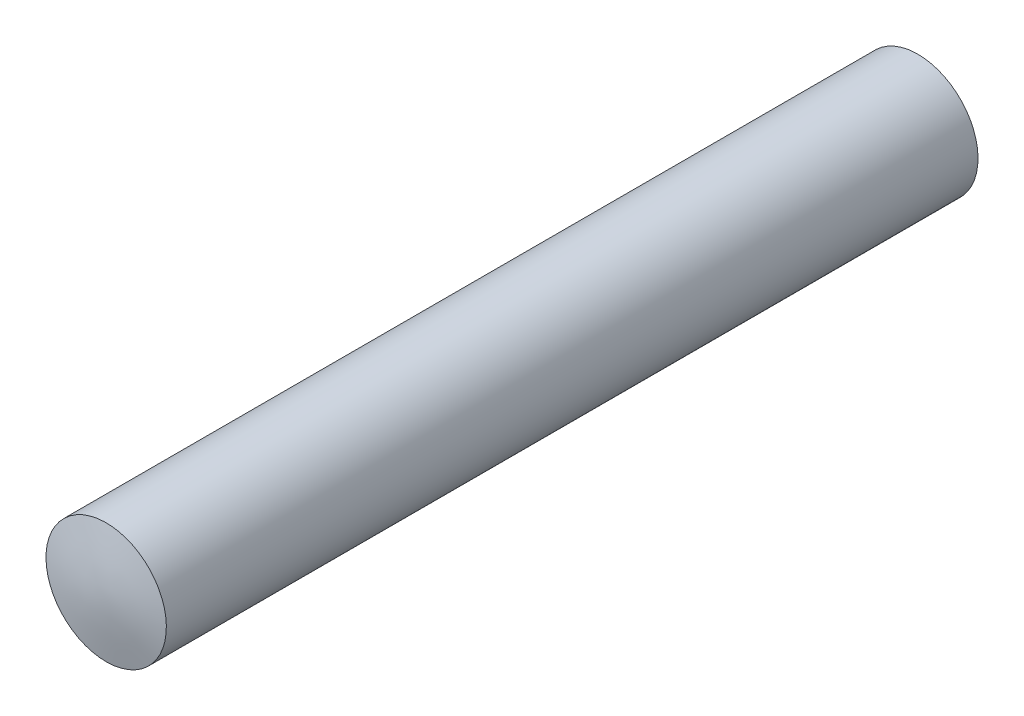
ISO-10303-21;
HEADER;
FILE_DESCRIPTION(('STEP AP214'),'2;1');
FILE_NAME('part.step','',(''),(''),'','','');
FILE_SCHEMA(('AUTOMOTIVE_DESIGN { 1 0 10303 214 1 1 1 1 }'));
ENDSEC;
DATA;
#1=APPLICATION_CONTEXT('core data for automotive mechanical design processes');
#2=APPLICATION_PROTOCOL_DEFINITION('international standard','automotive_design',2000,#1);
#3=PRODUCT_CONTEXT('',#1,'mechanical');
#4=PRODUCT('Part','Part','',(#3));
#5=PRODUCT_RELATED_PRODUCT_CATEGORY('part','',(#4));
#6=PRODUCT_DEFINITION_FORMATION('','',#4);
#7=PRODUCT_DEFINITION_CONTEXT('part definition',#1,'design');
#8=PRODUCT_DEFINITION('design','',#6,#7);
#9=PRODUCT_DEFINITION_SHAPE('','',#8);
#10=(LENGTH_UNIT() NAMED_UNIT(*) SI_UNIT(.MILLI.,.METRE.));
#11=(NAMED_UNIT(*) PLANE_ANGLE_UNIT() SI_UNIT($,.RADIAN.));
#12=(NAMED_UNIT(*) SI_UNIT($,.STERADIAN.) SOLID_ANGLE_UNIT());
#13=UNCERTAINTY_MEASURE_WITH_UNIT(LENGTH_MEASURE(1.E-05),#10,'distance_accuracy_value','');
#14=(GEOMETRIC_REPRESENTATION_CONTEXT(3) GLOBAL_UNCERTAINTY_ASSIGNED_CONTEXT((#13)) GLOBAL_UNIT_ASSIGNED_CONTEXT((#10,
#11,#12)) REPRESENTATION_CONTEXT('',''));
#15=CARTESIAN_POINT('',(0.,0.,0.));
#16=DIRECTION('',(0.,0.,1.));
#17=DIRECTION('',(1.,0.,0.));
#18=AXIS2_PLACEMENT_3D('',#15,#16,#17);
#19=CARTESIAN_POINT('',(0.,0.,10.7061));
#20=DIRECTION('',(0.,0.,-1.));
#21=DIRECTION('',(-1.,0.,0.));
#22=AXIS2_PLACEMENT_3D('',#19,#20,#21);
#23=CYLINDRICAL_SURFACE('',#22,1.5875);
#24=CARTESIAN_POINT('',(-1.5875,-1.49263197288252E-11,10.7062057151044));
#25=CARTESIAN_POINT('',(-1.58749604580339,-0.0891705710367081,10.7062060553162));
#26=CARTESIAN_POINT('',(-1.57996166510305,-0.178405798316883,10.7062164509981));
#27=CARTESIAN_POINT('',(-1.55001008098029,-0.354418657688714,10.7062147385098));
#28=CARTESIAN_POINT('',(-1.52757496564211,-0.44119320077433,10.7062026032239));
#29=CARTESIAN_POINT('',(-1.46846058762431,-0.609709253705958,10.7062039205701));
#30=CARTESIAN_POINT('',(-1.43178812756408,-0.691453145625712,10.706217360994));
#31=CARTESIAN_POINT('',(-1.34524940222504,-0.84760096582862,10.7062493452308));
#32=CARTESIAN_POINT('',(-1.29538641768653,-0.922006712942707,10.7062678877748));
#33=CARTESIAN_POINT('',(-1.18387200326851,-1.0614001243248,10.7062876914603));
#34=CARTESIAN_POINT('',(-1.12221934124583,-1.12638680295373,10.7062889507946));
#35=CARTESIAN_POINT('',(-0.988876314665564,-1.24508955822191,10.7062735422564));
#36=CARTESIAN_POINT('',(-0.917185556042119,-1.29880519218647,10.7062568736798));
#37=CARTESIAN_POINT('',(-0.765804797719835,-1.39343708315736,10.7062219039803));
#38=CARTESIAN_POINT('',(-0.686114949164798,-1.43435358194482,10.7062036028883));
#39=CARTESIAN_POINT('',(-0.520997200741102,-1.50222695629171,10.7062030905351));
#40=CARTESIAN_POINT('',(-0.435569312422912,-1.52918385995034,10.7062208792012));
#41=CARTESIAN_POINT('',(-0.26140023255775,-1.56837299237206,10.7062442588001));
#42=CARTESIAN_POINT('',(-0.172659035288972,-1.58060519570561,10.7062498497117));
#43=CARTESIAN_POINT('',(0.00561725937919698,-1.58999759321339,10.7062569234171));
#44=CARTESIAN_POINT('',(0.0951523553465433,-1.58715781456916,10.7062584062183));
#45=CARTESIAN_POINT('',(0.272475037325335,-1.56648691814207,10.7062423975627));
#46=CARTESIAN_POINT('',(0.360262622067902,-1.54865578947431,10.7062249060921));
#47=CARTESIAN_POINT('',(0.531598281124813,-1.4985083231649,10.7062044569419));
#48=CARTESIAN_POINT('',(0.615146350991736,-1.46619197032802,10.7062014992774));
#49=CARTESIAN_POINT('',(0.775631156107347,-1.38799143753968,10.7062201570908));
#50=CARTESIAN_POINT('',(0.852567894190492,-1.34210726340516,10.7062417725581));
#51=CARTESIAN_POINT('',(0.997646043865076,-1.23807361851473,10.7062742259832));
#52=CARTESIAN_POINT('',(1.06578745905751,-1.17992415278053,10.7062850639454));
#53=CARTESIAN_POINT('',(1.19134068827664,-1.05301058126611,10.7062874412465));
#54=CARTESIAN_POINT('',(1.24875249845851,-0.984246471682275,10.7062789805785));
#55=CARTESIAN_POINT('',(1.35121674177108,-0.838055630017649,10.7062491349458));
#56=CARTESIAN_POINT('',(1.3962691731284,-0.760628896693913,10.7062277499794));
#57=CARTESIAN_POINT('',(1.47273574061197,-0.599310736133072,10.7062059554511));
#58=CARTESIAN_POINT('',(1.50414987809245,-0.515419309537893,10.7062055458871));
#59=CARTESIAN_POINT('',(1.55244810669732,-0.343553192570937,10.7062085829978));
#60=CARTESIAN_POINT('',(1.56933219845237,-0.255578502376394,10.7062120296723));
#61=CARTESIAN_POINT('',(1.58809104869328,-0.0780431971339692,10.706211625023));
#62=CARTESIAN_POINT('',(1.58996580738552,0.0115174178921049,10.7062077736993));
#63=CARTESIAN_POINT('',(1.57865277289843,0.189682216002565,10.706208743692));
#64=CARTESIAN_POINT('',(1.56546497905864,0.278286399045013,10.7062135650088));
#65=CARTESIAN_POINT('',(1.5244011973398,0.452023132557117,10.7062102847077));
#66=CARTESIAN_POINT('',(1.49652520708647,0.537155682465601,10.7062021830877));
#67=CARTESIAN_POINT('',(1.42687635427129,0.701532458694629,10.7062147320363));
#68=CARTESIAN_POINT('',(1.38510349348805,0.780776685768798,10.7062353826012));
#69=CARTESIAN_POINT('',(1.2888467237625,0.931127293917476,10.7062690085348));
#70=CARTESIAN_POINT('',(1.23436281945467,1.00223367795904,10.7062819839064));
#71=CARTESIAN_POINT('',(1.1142305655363,1.13429016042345,10.7062888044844));
#72=CARTESIAN_POINT('',(1.04858221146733,1.19524025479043,10.7062826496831));
#73=CARTESIAN_POINT('',(0.907984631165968,1.30525393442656,10.7062557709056));
#74=CARTESIAN_POINT('',(0.833035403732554,1.3543175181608,10.7062350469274));
#75=CARTESIAN_POINT('',(0.675963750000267,1.43916535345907,10.7062068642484));
#76=CARTESIAN_POINT('',(0.593841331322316,1.47494961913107,10.7061994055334));
#77=CARTESIAN_POINT('',(0.424754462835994,1.53222307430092,10.7062137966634));
#78=CARTESIAN_POINT('',(0.337790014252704,1.55371226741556,10.706235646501));
#79=CARTESIAN_POINT('',(0.161487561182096,1.58178560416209,10.7062560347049));
#80=CARTESIAN_POINT('',(0.0721495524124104,1.58836972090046,10.7062545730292));
#81=CARTESIAN_POINT('',(-0.106363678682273,1.58644592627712,10.7062531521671));
#82=CARTESIAN_POINT('',(-0.195538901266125,1.57793803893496,10.7062531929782));
#83=CARTESIAN_POINT('',(-0.371195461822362,1.54607175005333,10.7062310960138));
#84=CARTESIAN_POINT('',(-0.457676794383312,1.52271331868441,10.7062089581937));
#85=CARTESIAN_POINT('',(-0.625491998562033,1.46180847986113,10.7061987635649));
#86=CARTESIAN_POINT('',(-0.706825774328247,1.42426180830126,10.7062107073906));
#87=CARTESIAN_POINT('',(-0.862032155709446,1.3360479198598,10.7062423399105));
#88=CARTESIAN_POINT('',(-0.935905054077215,1.28538121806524,10.7062620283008));
#89=CARTESIAN_POINT('',(-1.07408901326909,1.17237158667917,10.7062855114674));
#90=CARTESIAN_POINT('',(-1.13840107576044,1.11002988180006,10.7062893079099));
#91=CARTESIAN_POINT('',(-1.25566240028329,0.975416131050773,10.706278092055));
#92=CARTESIAN_POINT('',(-1.30860883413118,0.903141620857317,10.7062630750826));
#93=CARTESIAN_POINT('',(-1.40163627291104,0.75070131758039,10.7062291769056));
#94=CARTESIAN_POINT('',(-1.44171112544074,0.670531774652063,10.7062102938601));
#95=CARTESIAN_POINT('',(-1.50778654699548,0.504665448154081,10.7062016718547));
#96=CARTESIAN_POINT('',(-1.53380398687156,0.418975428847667,10.706211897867));
#97=CARTESIAN_POINT('',(-1.56409188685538,0.277282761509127,10.7062159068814));
#98=CARTESIAN_POINT('',(-1.57285897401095,0.222200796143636,10.7062144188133));
#99=CARTESIAN_POINT('',(-1.58456426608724,0.111420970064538,10.7062092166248));
#100=CARTESIAN_POINT('',(-1.58750247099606,0.0557231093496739,10.7062055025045));
#101=CARTESIAN_POINT('',(-1.5875,-1.49263197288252E-11,10.7062057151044));
#102=B_SPLINE_CURVE_WITH_KNOTS('',3,(#24,#25,#26,#27,#28,#29,#30,#31,#32,#33,#34,#35,#36,#37,
#38,#39,#40,#41,#42,#43,#44,#45,#46,#47,#48,#49,#50,#51,#52,#53,#54,#55,#56,#57,#58,#59,#60,#61,
#62,#63,#64,#65,#66,#67,#68,#69,#70,#71,#72,#73,#74,#75,#76,#77,#78,#79,#80,#81,#82,#83,#84,#85,
#86,#87,#88,#89,#90,#91,#92,#93,#94,#95,#96,#97,#98,#99,#100,#101),.UNSPECIFIED.,.T.,.F.,(4,2,2,
2,2,2,2,2,2,2,2,2,2,2,2,2,2,2,2,2,2,2,2,2,2,2,2,2,2,2,2,2,2,2,2,2,2,2,4),(0.,0.267308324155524,
0.534938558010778,0.802441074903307,1.06987712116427,1.33734113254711,1.60481564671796,
1.87228510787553,2.13975403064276,2.4072234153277,2.67469231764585,2.94216141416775,
3.20963079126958,3.4771000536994,3.74456920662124,4.01203845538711,4.27950774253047,
4.54697700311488,4.8144462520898,5.08191549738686,5.34938475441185,5.6168540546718,
5.88432332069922,6.15179248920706,6.41926176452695,6.68673107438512,6.95420010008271,
7.22166905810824,7.48913849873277,7.75660751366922,8.02407706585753,8.29155159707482,
8.55901562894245,8.8264516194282,9.09395408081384,9.36158421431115,9.628892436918,
9.79593466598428,9.96297689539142),.UNSPECIFIED.);
#103=CARTESIAN_POINT('',(-1.5875,-1.49263197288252E-11,10.7062057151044));
#104=VERTEX_POINT('',#103);
#105=EDGE_CURVE('E12',#104,#104,#102,.T.);
#106=ORIENTED_EDGE('',*,*,#105,.F.);
#107=EDGE_LOOP('',(#106));
#108=FACE_BOUND('',#107,.T.);
#109=CARTESIAN_POINT('',(-1.5875,1.50157528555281E-11,-10.706205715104));
#110=CARTESIAN_POINT('',(-1.58749604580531,-0.0891705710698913,-10.7062060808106));
#111=CARTESIAN_POINT('',(-1.57996166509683,-0.178405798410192,-10.7062165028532));
#112=CARTESIAN_POINT('',(-1.55001008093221,-0.35441865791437,-10.7062148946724));
#113=CARTESIAN_POINT('',(-1.52757496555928,-0.441193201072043,-10.7062028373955));
#114=CARTESIAN_POINT('',(-1.46846058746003,-0.609709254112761,-10.706204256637));
#115=CARTESIAN_POINT('',(-1.43178812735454,-0.691453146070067,-10.7062177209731));
#116=CARTESIAN_POINT('',(-1.34524940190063,-0.847600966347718,-10.706249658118));
#117=CARTESIAN_POINT('',(-1.29538641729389,-0.922006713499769,-10.7062681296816));
#118=CARTESIAN_POINT('',(-1.18387200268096,-1.06140012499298,-10.7062877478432));
#119=CARTESIAN_POINT('',(-1.12221934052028,-1.12638680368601,-10.7062888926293));
#120=CARTESIAN_POINT('',(-0.988876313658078,-1.24508955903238,-10.706273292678));
#121=CARTESIAN_POINT('',(-0.917185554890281,-1.29880519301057,-10.706256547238));
#122=CARTESIAN_POINT('',(-0.765804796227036,-1.39343708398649,-10.7062215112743));
#123=CARTESIAN_POINT('',(-0.686114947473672,-1.43435358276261,-10.7062032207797));
#124=CARTESIAN_POINT('',(-0.520997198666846,-1.50222695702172,-10.7062027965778));
#125=CARTESIAN_POINT('',(-0.435569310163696,-1.52918386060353,-10.7062206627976));
#126=CARTESIAN_POINT('',(-0.261400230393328,-1.56837299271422,-10.7062441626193));
#127=CARTESIAN_POINT('',(-0.172659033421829,-1.58060519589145,-10.7062497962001));
#128=CARTESIAN_POINT('',(0.00561726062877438,-1.58999759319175,-10.7062569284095));
#129=CARTESIAN_POINT('',(0.0951523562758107,-1.58715781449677,-10.7062584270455));
#130=CARTESIAN_POINT('',(0.272475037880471,-1.56648691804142,-10.7062424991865));
#131=CARTESIAN_POINT('',(0.360262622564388,-1.54865578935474,-10.7062250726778));
#132=CARTESIAN_POINT('',(0.531598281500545,-1.49850832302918,-10.7062047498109));
#133=CARTESIAN_POINT('',(0.61514635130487,-1.4661919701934,-10.7062018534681));
#134=CARTESIAN_POINT('',(0.77563115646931,-1.38799143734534,-10.706220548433));
#135=CARTESIAN_POINT('',(0.852567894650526,-1.3421072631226,-10.7062421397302));
#136=CARTESIAN_POINT('',(0.99764604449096,-1.23807361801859,-10.7062744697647));
#137=CARTESIAN_POINT('',(1.06578745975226,-1.17992415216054,-10.7062852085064));
#138=CARTESIAN_POINT('',(1.19134068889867,-1.05301058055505,-10.7062873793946));
#139=CARTESIAN_POINT('',(1.2487524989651,-0.984246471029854,-10.7062788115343));
#140=CARTESIAN_POINT('',(1.35121674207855,-0.838055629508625,-10.7062488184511));
#141=CARTESIAN_POINT('',(1.39626917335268,-0.760628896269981,-10.7062273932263));
#142=CARTESIAN_POINT('',(1.47273574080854,-0.599310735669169,-10.7062056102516));
#143=CARTESIAN_POINT('',(1.50414987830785,-0.515419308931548,-10.7062052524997));
#144=CARTESIAN_POINT('',(1.55244810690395,-0.343553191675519,-10.7062084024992));
#145=CARTESIAN_POINT('',(1.56933219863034,-0.255578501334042,-10.7062119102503));
#146=CARTESIAN_POINT('',(1.58809104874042,-0.0780431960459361,-10.7062115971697));
#147=CARTESIAN_POINT('',(1.5899658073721,0.01151741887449,-10.7062077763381));
#148=CARTESIAN_POINT('',(1.57865277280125,0.189682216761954,-10.7062088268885));
#149=CARTESIAN_POINT('',(1.56546497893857,0.278286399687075,-10.706213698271));
#150=CARTESIAN_POINT('',(1.52440119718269,0.452023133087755,-10.70621053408));
#151=CARTESIAN_POINT('',(1.49652520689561,0.537155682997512,-10.7062024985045));
#152=CARTESIAN_POINT('',(1.42687635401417,0.701532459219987,-10.7062150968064));
#153=CARTESIAN_POINT('',(1.3851034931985,0.780776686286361,-10.7062357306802));
#154=CARTESIAN_POINT('',(1.28884672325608,0.931127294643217,-10.7062692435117));
#155=CARTESIAN_POINT('',(1.23436281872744,1.00223367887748,-10.7062821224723));
#156=CARTESIAN_POINT('',(1.11423056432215,1.13429016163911,-10.706288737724));
#157=CARTESIAN_POINT('',(1.04858220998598,1.19524025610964,-10.7062824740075));
#158=CARTESIAN_POINT('',(0.907984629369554,1.30525393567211,-10.7062554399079));
#159=CARTESIAN_POINT('',(0.833035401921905,1.35431751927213,-10.706234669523));
#160=CARTESIAN_POINT('',(0.675963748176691,1.4391653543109,-10.7062064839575));
#161=CARTESIAN_POINT('',(0.593841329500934,1.47494961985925,-10.7061990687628));
#162=CARTESIAN_POINT('',(0.424754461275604,1.53222307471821,-10.706213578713));
#163=CARTESIAN_POINT('',(0.33779001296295,1.55371226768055,-10.7062355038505));
#164=CARTESIAN_POINT('',(0.16148756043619,1.58178560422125,-10.7062559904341));
#165=CARTESIAN_POINT('',(0.072149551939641,1.58836972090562,-10.7062545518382));
#166=CARTESIAN_POINT('',(-0.106363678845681,1.58644592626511,-10.7062531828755));
#167=CARTESIAN_POINT('',(-0.195538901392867,1.57793803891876,-10.7062532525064));
#168=CARTESIAN_POINT('',(-0.371195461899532,1.54607175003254,-10.7062312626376));
#169=CARTESIAN_POINT('',(-0.457676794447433,1.52271331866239,-10.7062092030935));
#170=CARTESIAN_POINT('',(-0.625491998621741,1.46180847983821,-10.7061991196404));
#171=CARTESIAN_POINT('',(-0.706825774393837,1.42426180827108,-10.7062110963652));
#172=CARTESIAN_POINT('',(-0.862032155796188,1.3360479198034,-10.7062427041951));
#173=CARTESIAN_POINT('',(-0.935905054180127,1.28538121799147,-10.7062623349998));
#174=CARTESIAN_POINT('',(-1.07408901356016,1.17237158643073,-10.7062856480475));
#175=CARTESIAN_POINT('',(-1.13840107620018,1.11002988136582,-10.7062893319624));
#176=CARTESIAN_POINT('',(-1.25566240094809,0.975416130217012,-10.7062779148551));
#177=CARTESIAN_POINT('',(-1.30860883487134,0.903141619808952,-10.7062628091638));
#178=CARTESIAN_POINT('',(-1.40163627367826,0.750701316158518,-10.7062288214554));
#179=CARTESIAN_POINT('',(-1.44171112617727,0.670531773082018,-10.7062099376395));
#180=CARTESIAN_POINT('',(-1.50778654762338,0.504665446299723,-10.7062013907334));
#181=CARTESIAN_POINT('',(-1.53380398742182,0.418975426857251,-10.7062116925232));
#182=CARTESIAN_POINT('',(-1.56409188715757,0.277282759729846,-10.7062157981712));
#183=CARTESIAN_POINT('',(-1.57285897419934,0.222200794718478,-10.7062143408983));
#184=CARTESIAN_POINT('',(-1.58456426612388,0.111420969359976,-10.7062091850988));
#185=CARTESIAN_POINT('',(-1.58750247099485,0.0557231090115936,-10.7062054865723));
#186=CARTESIAN_POINT('',(-1.5875,1.50157528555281E-11,-10.706205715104));
#187=B_SPLINE_CURVE_WITH_KNOTS('',3,(#109,#110,#111,#112,#113,#114,#115,#116,#117,#118,#119,
#120,#121,#122,#123,#124,#125,#126,#127,#128,#129,#130,#131,#132,#133,#134,#135,#136,#137,#138,
#139,#140,#141,#142,#143,#144,#145,#146,#147,#148,#149,#150,#151,#152,#153,#154,#155,#156,#157,
#158,#159,#160,#161,#162,#163,#164,#165,#166,#167,#168,#169,#170,#171,#172,#173,#174,#175,#176,
#177,#178,#179,#180,#181,#182,#183,#184,#185,#186),.UNSPECIFIED.,.T.,.F.,(4,2,2,2,2,2,2,2,2,2,2,
2,2,2,2,2,2,2,2,2,2,2,2,2,2,2,2,2,2,2,2,2,2,2,2,2,2,2,4),(0.,0.267308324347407,
0.534938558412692,0.802441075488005,1.06987712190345,1.33734113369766,1.60481564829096,
1.8722851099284,2.13975403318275,2.40722341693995,2.6746923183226,2.94216141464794,
3.20963079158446,3.47710005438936,3.74456920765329,4.01203845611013,4.27950774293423,
4.54697700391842,4.81444625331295,5.08191549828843,5.34938475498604,5.61685405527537,
5.88432332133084,6.15179249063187,6.41926176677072,6.68673107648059,6.95420010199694,
7.22166905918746,7.48913849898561,7.756607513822,8.02407706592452,8.29155159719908,
8.55901562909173,8.82645162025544,9.09395408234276,9.36158421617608,9.62889243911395,
9.79593466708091,9.96297689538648),.UNSPECIFIED.);
#188=CARTESIAN_POINT('',(-1.5875,1.50157528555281E-11,-10.706205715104));
#189=VERTEX_POINT('',#188);
#190=EDGE_CURVE('E107',#189,#189,#187,.T.);
#191=ORIENTED_EDGE('',*,*,#190,.T.);
#192=EDGE_LOOP('',(#191));
#193=FACE_BOUND('',#192,.T.);
#194=ADVANCED_FACE('F93',(#108,#193),#23,.T.);
#195=CARTESIAN_POINT('',(1.68852205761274,-1.61923509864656,10.5525788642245));
#196=CARTESIAN_POINT('',(1.41835918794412,-1.61923509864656,10.5895951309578));
#197=CARTESIAN_POINT('',(1.14819631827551,-1.61923509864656,10.6232669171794));
#198=CARTESIAN_POINT('',(0.878033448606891,-1.61923509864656,10.654639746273));
#199=CARTESIAN_POINT('',(0.472788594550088,-1.61923509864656,10.6906518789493));
#200=CARTESIAN_POINT('',(0.0675437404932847,-1.61923509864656,10.7006069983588));
#201=CARTESIAN_POINT('',(-0.0675382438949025,-1.61923509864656,10.7006070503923));
#202=CARTESIAN_POINT('',(-0.472784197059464,-1.61923509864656,10.6906523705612));
#203=CARTESIAN_POINT('',(-0.878030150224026,-1.61923509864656,10.6546408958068));
#204=CARTESIAN_POINT('',(-1.1481941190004,-1.61923509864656,10.6232680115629));
#205=CARTESIAN_POINT('',(-1.41835808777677,-1.61923509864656,10.5895957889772));
#206=CARTESIAN_POINT('',(-1.68852205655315,-1.61923509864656,10.5525789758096));
#207=CARTESIAN_POINT('',(1.68852205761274,-1.36015811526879,10.5856697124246));
#208=CARTESIAN_POINT('',(1.41835918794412,-1.36015811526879,10.6285133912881));
#209=CARTESIAN_POINT('',(1.14819631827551,-1.36015811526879,10.6679637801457));
#210=CARTESIAN_POINT('',(0.878033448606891,-1.36015811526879,10.7053592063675));
#211=CARTESIAN_POINT('',(0.472788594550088,-1.36015811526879,10.7485364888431));
#212=CARTESIAN_POINT('',(0.0675437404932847,-1.36015811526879,10.7604944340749));
#213=CARTESIAN_POINT('',(-0.0675382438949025,-1.36015811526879,10.7604945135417));
#214=CARTESIAN_POINT('',(-0.472784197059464,-1.36015811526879,10.7485370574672));
#215=CARTESIAN_POINT('',(-0.878030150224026,-1.36015811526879,10.7053602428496));
#216=CARTESIAN_POINT('',(-1.1481941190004,-1.36015811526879,10.6679644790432));
#217=CARTESIAN_POINT('',(-1.41835808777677,-1.36015811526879,10.6285136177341));
#218=CARTESIAN_POINT('',(-1.68852205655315,-1.36015811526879,10.5856693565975));
#219=CARTESIAN_POINT('',(1.68852205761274,-1.10108113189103,10.6156878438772));
#220=CARTESIAN_POINT('',(1.41835918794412,-1.10108113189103,10.6643130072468));
#221=CARTESIAN_POINT('',(1.14819631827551,-1.10108113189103,10.7094462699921));
#222=CARTESIAN_POINT('',(0.878033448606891,-1.10108113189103,10.7530804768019));
#223=CARTESIAN_POINT('',(0.472788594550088,-1.10108113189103,10.8036566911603));
#224=CARTESIAN_POINT('',(0.0675437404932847,-1.10108113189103,10.8176837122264));
#225=CARTESIAN_POINT('',(-0.0675382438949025,-1.10108113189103,10.8176838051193));
#226=CARTESIAN_POINT('',(-0.472784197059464,-1.10108113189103,10.8036573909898));
#227=CARTESIAN_POINT('',(-0.878030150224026,-1.10108113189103,10.7530813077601));
#228=CARTESIAN_POINT('',(-1.1481941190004,-1.10108113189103,10.709446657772));
#229=CARTESIAN_POINT('',(-1.41835808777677,-1.10108113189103,10.6643128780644));
#230=CARTESIAN_POINT('',(-1.68852205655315,-1.10108113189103,10.6156870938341));
#231=CARTESIAN_POINT('',(1.68852205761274,-0.842004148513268,10.6435630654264));
#232=CARTESIAN_POINT('',(1.41835918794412,-0.842004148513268,10.6982260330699));
#233=CARTESIAN_POINT('',(1.14819631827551,-0.842004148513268,10.7495761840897));
#234=CARTESIAN_POINT('',(0.878033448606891,-0.842004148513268,10.8000077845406));
#235=CARTESIAN_POINT('',(0.472788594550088,-0.842004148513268,10.8575481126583));
#236=CARTESIAN_POINT('',(0.0675437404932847,-0.842004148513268,10.8736895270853));
#237=CARTESIAN_POINT('',(-0.0675382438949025,-0.842004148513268,10.8736896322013));
#238=CARTESIAN_POINT('',(-0.472784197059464,-0.842004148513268,10.8575487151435));
#239=CARTESIAN_POINT('',(-0.878030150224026,-0.842004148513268,10.8000084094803));
#240=CARTESIAN_POINT('',(-1.1481941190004,-0.842004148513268,10.7495762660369));
#241=CARTESIAN_POINT('',(-1.41835808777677,-0.842004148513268,10.69822566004));
#242=CARTESIAN_POINT('',(-1.68852205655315,-0.842004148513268,10.643562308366));
#243=CARTESIAN_POINT('',(1.68852205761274,-0.45338814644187,10.6752947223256));
#244=CARTESIAN_POINT('',(1.41835918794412,-0.45338814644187,10.7372426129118));
#245=CARTESIAN_POINT('',(1.14819631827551,-0.45338814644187,10.7961485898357));
#246=CARTESIAN_POINT('',(0.878033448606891,-0.45338814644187,10.8536507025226));
#247=CARTESIAN_POINT('',(0.472788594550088,-0.45338814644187,10.9244525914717));
#248=CARTESIAN_POINT('',(0.0675437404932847,-0.45338814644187,10.9446353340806));
#249=CARTESIAN_POINT('',(-0.0675382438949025,-0.45338814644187,10.9446354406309));
#250=CARTESIAN_POINT('',(-0.472784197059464,-0.45338814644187,10.9244532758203));
#251=CARTESIAN_POINT('',(-0.878030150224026,-0.45338814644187,10.8536513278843));
#252=CARTESIAN_POINT('',(-1.1481941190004,-0.45338814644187,10.7961488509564));
#253=CARTESIAN_POINT('',(-1.41835808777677,-0.45338814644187,10.7372427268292));
#254=CARTESIAN_POINT('',(-1.68852205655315,-0.45338814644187,10.6752945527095));
#255=CARTESIAN_POINT('',(1.68852205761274,-0.0647721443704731,10.6839854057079));
#256=CARTESIAN_POINT('',(1.41835918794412,-0.0647721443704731,10.7479902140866));
#257=CARTESIAN_POINT('',(1.14819631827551,-0.0647721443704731,10.8090663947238));
#258=CARTESIAN_POINT('',(0.878033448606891,-0.0647721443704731,10.868728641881));
#259=CARTESIAN_POINT('',(0.472788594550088,-0.0647721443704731,10.9435838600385));
#260=CARTESIAN_POINT('',(0.0675437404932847,-0.0647721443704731,10.9667462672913));
#261=CARTESIAN_POINT('',(-0.0675382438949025,-0.0647721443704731,10.9667464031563));
#262=CARTESIAN_POINT('',(-0.472784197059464,-0.0647721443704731,10.9435846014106));
#263=CARTESIAN_POINT('',(-0.878030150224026,-0.0647721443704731,10.8687293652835));
#264=CARTESIAN_POINT('',(-1.1481941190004,-0.0647721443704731,10.8090668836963));
#265=CARTESIAN_POINT('',(-1.41835808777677,-0.0647721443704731,10.7479904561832));
#266=CARTESIAN_POINT('',(-1.68852205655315,-0.0647721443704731,10.683985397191));
#267=CARTESIAN_POINT('',(1.68852205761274,0.0647668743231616,10.6839854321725));
#268=CARTESIAN_POINT('',(1.41835918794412,0.0647668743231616,10.7479902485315));
#269=CARTESIAN_POINT('',(1.14819631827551,0.0647668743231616,10.8090664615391));
#270=CARTESIAN_POINT('',(0.878033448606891,0.0647668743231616,10.8687287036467));
#271=CARTESIAN_POINT('',(0.472788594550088,0.0647668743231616,10.9435839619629));
#272=CARTESIAN_POINT('',(0.0675437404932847,0.0647668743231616,10.9667463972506));
#273=CARTESIAN_POINT('',(-0.0675382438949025,0.0647668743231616,10.9667465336));
#274=CARTESIAN_POINT('',(-0.472784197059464,0.0647668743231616,10.9435847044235));
#275=CARTESIAN_POINT('',(-0.878030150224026,0.0647668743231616,10.8687294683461));
#276=CARTESIAN_POINT('',(-1.1481941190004,0.0647668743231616,10.8090669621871));
#277=CARTESIAN_POINT('',(-1.41835808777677,0.0647668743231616,10.7479905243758));
#278=CARTESIAN_POINT('',(-1.68852205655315,0.0647668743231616,10.6839854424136));
#279=CARTESIAN_POINT('',(1.68852205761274,0.453383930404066,10.6752948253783));
#280=CARTESIAN_POINT('',(1.41835918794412,0.453383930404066,10.7372428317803));
#281=CARTESIAN_POINT('',(1.14819631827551,0.453383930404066,10.7961488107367));
#282=CARTESIAN_POINT('',(0.878033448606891,0.453383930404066,10.8536511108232));
#283=CARTESIAN_POINT('',(0.472788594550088,0.453383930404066,10.9244532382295));
#284=CARTESIAN_POINT('',(0.0675437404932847,0.453383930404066,10.944636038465));
#285=CARTESIAN_POINT('',(-0.0675382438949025,0.453383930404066,10.9446361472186));
#286=CARTESIAN_POINT('',(-0.472784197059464,0.453383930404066,10.924453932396));
#287=CARTESIAN_POINT('',(-0.878030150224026,0.453383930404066,10.8536519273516));
#288=CARTESIAN_POINT('',(-1.1481941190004,0.453383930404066,10.7961495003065));
#289=CARTESIAN_POINT('',(-1.41835808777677,0.453383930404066,10.7372432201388));
#290=CARTESIAN_POINT('',(-1.68852205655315,0.453383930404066,10.6752949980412));
#291=CARTESIAN_POINT('',(1.68852205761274,0.84200098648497,10.6435626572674));
#292=CARTESIAN_POINT('',(1.41835918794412,0.84200098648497,10.6982258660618));
#293=CARTESIAN_POINT('',(1.14819631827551,0.84200098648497,10.7495763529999));
#294=CARTESIAN_POINT('',(0.878033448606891,0.84200098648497,10.8000083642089));
#295=CARTESIAN_POINT('',(0.472788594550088,0.84200098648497,10.8575488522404));
#296=CARTESIAN_POINT('',(0.0675437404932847,0.84200098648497,10.8736902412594));
#297=CARTESIAN_POINT('',(-0.0675382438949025,0.84200098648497,10.8736903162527));
#298=CARTESIAN_POINT('',(-0.472784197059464,0.84200098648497,10.8575493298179));
#299=CARTESIAN_POINT('',(-0.878030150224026,0.84200098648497,10.8000089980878));
#300=CARTESIAN_POINT('',(-1.1481941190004,0.84200098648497,10.7495771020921));
#301=CARTESIAN_POINT('',(-1.41835808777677,0.84200098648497,10.6982266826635));
#302=CARTESIAN_POINT('',(-1.68852205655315,0.84200098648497,10.6435634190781));
#303=CARTESIAN_POINT('',(1.68852205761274,1.10107902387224,10.6156873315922));
#304=CARTESIAN_POINT('',(1.41835918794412,1.10107902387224,10.6643129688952));
#305=CARTESIAN_POINT('',(1.14819631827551,1.10107902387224,10.7094466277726));
#306=CARTESIAN_POINT('',(0.878033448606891,1.10107902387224,10.7530811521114));
#307=CARTESIAN_POINT('',(0.472788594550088,1.10107902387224,10.8036573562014));
#308=CARTESIAN_POINT('',(0.0675437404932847,1.10107902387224,10.8176841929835));
#309=CARTESIAN_POINT('',(-0.0675382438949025,1.10107902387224,10.8176842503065));
#310=CARTESIAN_POINT('',(-0.472784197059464,1.10107902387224,10.80365761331));
#311=CARTESIAN_POINT('',(-0.878030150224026,1.10107902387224,10.7530814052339));
#312=CARTESIAN_POINT('',(-1.1481941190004,1.10107902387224,10.7094469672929));
#313=CARTESIAN_POINT('',(-1.41835808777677,1.10107902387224,10.6643134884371));
#314=CARTESIAN_POINT('',(-1.68852205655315,1.10107902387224,10.6156880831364));
#315=CARTESIAN_POINT('',(1.68852205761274,1.36015706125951,10.5856694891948));
#316=CARTESIAN_POINT('',(1.41835918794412,1.36015706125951,10.6285136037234));
#317=CARTESIAN_POINT('',(1.14819631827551,1.36015706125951,10.6679643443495));
#318=CARTESIAN_POINT('',(0.878033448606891,1.36015706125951,10.705359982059));
#319=CARTESIAN_POINT('',(0.472788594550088,1.36015706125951,10.7485368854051));
#320=CARTESIAN_POINT('',(0.0675437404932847,1.36015706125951,10.760494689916));
#321=CARTESIAN_POINT('',(-0.0675382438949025,1.36015706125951,10.7604947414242));
#322=CARTESIAN_POINT('',(-0.472784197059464,1.36015706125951,10.7485371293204));
#323=CARTESIAN_POINT('',(-0.878030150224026,1.36015706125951,10.7053598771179));
#324=CARTESIAN_POINT('',(-1.1481941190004,1.36015706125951,10.6679642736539));
#325=CARTESIAN_POINT('',(-1.41835808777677,1.36015706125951,10.6285137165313));
#326=CARTESIAN_POINT('',(-1.68852205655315,1.36015706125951,10.5856698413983));
#327=CARTESIAN_POINT('',(1.68852205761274,1.61923509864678,10.5525789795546));
#328=CARTESIAN_POINT('',(1.41835918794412,1.61923509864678,10.5895956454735));
#329=CARTESIAN_POINT('',(1.14819631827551,1.61923509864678,10.6232677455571));
#330=CARTESIAN_POINT('',(0.878033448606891,1.61923509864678,10.6546405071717));
#331=CARTESIAN_POINT('',(0.472788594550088,1.61923509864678,10.6906520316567));
#332=CARTESIAN_POINT('',(0.0675437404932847,1.61923509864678,10.7006069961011));
#333=CARTESIAN_POINT('',(-0.0675382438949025,1.61923509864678,10.7006070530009));
#334=CARTESIAN_POINT('',(-0.472784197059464,1.61923509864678,10.6906522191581));
#335=CARTESIAN_POINT('',(-0.878030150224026,1.61923509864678,10.6546401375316));
#336=CARTESIAN_POINT('',(-1.1481941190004,1.61923509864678,10.6232671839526));
#337=CARTESIAN_POINT('',(-1.41835808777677,1.61923509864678,10.5895952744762));
#338=CARTESIAN_POINT('',(-1.68852205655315,1.61923509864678,10.5525788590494));
#339=B_SPLINE_SURFACE_WITH_KNOTS('',5,5,((#195,#196,#197,#198,#199,#200,#201,#202,#203,#204,
#205,#206),(#207,#208,#209,#210,#211,#212,#213,#214,#215,#216,#217,#218),(#219,#220,#221,#222,
#223,#224,#225,#226,#227,#228,#229,#230),(#231,#232,#233,#234,#235,#236,#237,#238,#239,#240,
#241,#242),(#243,#244,#245,#246,#247,#248,#249,#250,#251,#252,#253,#254),(#255,#256,#257,#258,
#259,#260,#261,#262,#263,#264,#265,#266),(#267,#268,#269,#270,#271,#272,#273,#274,#275,#276,
#277,#278),(#279,#280,#281,#282,#283,#284,#285,#286,#287,#288,#289,#290),(#291,#292,#293,#294,
#295,#296,#297,#298,#299,#300,#301,#302),(#303,#304,#305,#306,#307,#308,#309,#310,#311,#312,
#313,#314),(#315,#316,#317,#318,#319,#320,#321,#322,#323,#324,#325,#326),(#327,#328,#329,#330,
#331,#332,#333,#334,#335,#336,#337,#338)),.UNSPECIFIED.,.F.,.F.,.F.,(6,3,3,6),(6,3,3,6),
(-1.61923509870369,-0.32385018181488,0.323844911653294,1.61923509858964),(-1.68852205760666,
-0.337707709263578,0.337702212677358,1.68852205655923),.UNSPECIFIED.);
#340=ORIENTED_EDGE('',*,*,#105,.T.);
#341=EDGE_LOOP('',(#340));
#342=FACE_BOUND('',#341,.T.);
#343=ADVANCED_FACE('F95',(#342),#339,.T.);
#344=CARTESIAN_POINT('',(1.68852205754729,-1.61923509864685,-10.5525789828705));
#345=CARTESIAN_POINT('',(1.41835918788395,-1.61923509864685,-10.589595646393));
#346=CARTESIAN_POINT('',(1.14819631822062,-1.61923509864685,-10.6232677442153));
#347=CARTESIAN_POINT('',(0.878033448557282,-1.61923509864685,-10.6546405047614));
#348=CARTESIAN_POINT('',(0.4727885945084,-1.61923509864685,-10.6906520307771));
#349=CARTESIAN_POINT('',(0.0675437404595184,-1.61923509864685,-10.7006069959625));
#350=CARTESIAN_POINT('',(-0.0675382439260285,-1.61923509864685,-10.7006070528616));
#351=CARTESIAN_POINT('',(-0.472784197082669,-1.61923509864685,-10.690652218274));
#352=CARTESIAN_POINT('',(-0.87803015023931,-1.61923509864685,-10.654640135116));
#353=CARTESIAN_POINT('',(-1.1481941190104,-1.61923509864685,-10.6232671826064));
#354=CARTESIAN_POINT('',(-1.4183580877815,-1.61923509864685,-10.5895952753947));
#355=CARTESIAN_POINT('',(-1.68852205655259,-1.61923509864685,-10.5525788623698));
#356=CARTESIAN_POINT('',(1.68852205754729,-1.36015811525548,-10.5856693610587));
#357=CARTESIAN_POINT('',(1.41835918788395,-1.36015811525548,-10.628513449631));
#358=CARTESIAN_POINT('',(1.14819631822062,-1.36015811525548,-10.6679641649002));
#359=CARTESIAN_POINT('',(0.878033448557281,-1.36015811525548,-10.7053597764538));
#360=CARTESIAN_POINT('',(0.4727885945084,-1.36015811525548,-10.7485366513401));
#361=CARTESIAN_POINT('',(0.0675437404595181,-1.36015811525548,-10.7604944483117));
#362=CARTESIAN_POINT('',(-0.0675382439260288,-1.36015811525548,-10.760494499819));
#363=CARTESIAN_POINT('',(-0.47278419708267,-1.36015811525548,-10.748536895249));
#364=CARTESIAN_POINT('',(-0.87803015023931,-1.36015811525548,-10.7053596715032));
#365=CARTESIAN_POINT('',(-1.1481941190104,-1.36015811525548,-10.667964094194));
#366=CARTESIAN_POINT('',(-1.4183580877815,-1.36015811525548,-10.6285135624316));
#367=CARTESIAN_POINT('',(-1.68852205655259,-1.36015811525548,-10.5856697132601));
#368=CARTESIAN_POINT('',(1.68852205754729,-1.10108113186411,-10.6156870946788));
#369=CARTESIAN_POINT('',(1.41835918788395,-1.10108113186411,-10.6643126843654));
#370=CARTESIAN_POINT('',(1.14819631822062,-1.10108113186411,-10.7094462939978));
#371=CARTESIAN_POINT('',(0.878033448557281,-1.10108113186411,-10.7530807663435));
#372=CARTESIAN_POINT('',(0.4727885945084,-1.10108113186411,-10.8036569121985));
#373=CARTESIAN_POINT('',(0.0675437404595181,-1.10108113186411,-10.8176837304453));
#374=CARTESIAN_POINT('',(-0.0675382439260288,-1.10108113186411,-10.8176837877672));
#375=CARTESIAN_POINT('',(-0.47278419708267,-1.10108113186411,-10.8036571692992));
#376=CARTESIAN_POINT('',(-0.87803015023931,-1.10108113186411,-10.7530810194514));
#377=CARTESIAN_POINT('',(-1.1481941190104,-1.10108113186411,-10.7094466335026));
#378=CARTESIAN_POINT('',(-1.4183580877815,-1.10108113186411,-10.6643132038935));
#379=CARTESIAN_POINT('',(-1.68852205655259,-1.10108113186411,-10.615687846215));
#380=CARTESIAN_POINT('',(1.68852205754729,-0.842004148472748,-10.6435623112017));
#381=CARTESIAN_POINT('',(1.41835918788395,-0.842004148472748,-10.6982254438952));
#382=CARTESIAN_POINT('',(1.14819631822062,-0.842004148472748,-10.7495758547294));
#383=CARTESIAN_POINT('',(0.878033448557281,-0.842004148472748,-10.8000077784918));
#384=CARTESIAN_POINT('',(0.4727885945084,-0.842004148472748,-10.8575481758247));
#385=CARTESIAN_POINT('',(0.0675437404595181,-0.842004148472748,-10.8736895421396));
#386=CARTESIAN_POINT('',(-0.0675382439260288,-0.842004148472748,-10.8736896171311));
#387=CARTESIAN_POINT('',(-0.47278419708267,-0.842004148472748,-10.8575486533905));
#388=CARTESIAN_POINT('',(-0.87803015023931,-0.842004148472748,-10.8000084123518));
#389=CARTESIAN_POINT('',(-1.1481941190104,-0.842004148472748,-10.7495766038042));
#390=CARTESIAN_POINT('',(-1.4183580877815,-0.842004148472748,-10.6982262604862));
#391=CARTESIAN_POINT('',(-1.68852205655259,-0.842004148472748,-10.6435630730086));
#392=CARTESIAN_POINT('',(1.68852205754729,-0.453388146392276,-10.67529452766));
#393=CARTESIAN_POINT('',(1.41835918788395,-0.453388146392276,-10.737242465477));
#394=CARTESIAN_POINT('',(1.14819631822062,-0.453388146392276,-10.7961483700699));
#395=CARTESIAN_POINT('',(0.878033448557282,-0.453388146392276,-10.8536506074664));
#396=CARTESIAN_POINT('',(0.4727885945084,-0.453388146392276,-10.9244525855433));
#397=CARTESIAN_POINT('',(0.0675437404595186,-0.453388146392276,-10.9446353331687));
#398=CARTESIAN_POINT('',(-0.0675382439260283,-0.453388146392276,-10.9446354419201));
#399=CARTESIAN_POINT('',(-0.472784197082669,-0.453388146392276,-10.9244532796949));
#400=CARTESIAN_POINT('',(-0.87803015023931,-0.453388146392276,-10.853651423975));
#401=CARTESIAN_POINT('',(-1.1481941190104,-0.453388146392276,-10.7961490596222));
#402=CARTESIAN_POINT('',(-1.4183580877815,-0.453388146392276,-10.7372428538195));
#403=CARTESIAN_POINT('',(-1.68852205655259,-0.453388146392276,-10.6752947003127));
#404=CARTESIAN_POINT('',(1.68852205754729,-0.0647721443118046,-10.6839853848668));
#405=CARTESIAN_POINT('',(1.41835918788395,-0.0647721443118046,-10.7479901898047));
#406=CARTESIAN_POINT('',(1.14819631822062,-0.0647721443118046,-10.8090663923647));
#407=CARTESIAN_POINT('',(0.878033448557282,-0.0647721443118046,-10.868728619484));
#408=CARTESIAN_POINT('',(0.4727885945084,-0.0647721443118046,-10.9435838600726));
#409=CARTESIAN_POINT('',(0.0675437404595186,-0.0647721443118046,-10.9667462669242));
#410=CARTESIAN_POINT('',(-0.0675382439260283,-0.0647721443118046,-10.9667464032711));
#411=CARTESIAN_POINT('',(-0.472784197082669,-0.0647721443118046,-10.9435846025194));
#412=CARTESIAN_POINT('',(-0.87803015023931,-0.0647721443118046,-10.8687293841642));
#413=CARTESIAN_POINT('',(-1.1481941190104,-0.0647721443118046,-10.8090668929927));
#414=CARTESIAN_POINT('',(-1.4183580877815,-0.0647721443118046,-10.7479904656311));
#415=CARTESIAN_POINT('',(-1.68852205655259,-0.0647721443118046,-10.683985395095));
#416=CARTESIAN_POINT('',(1.68852205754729,0.0647668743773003,-10.6839854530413));
#417=CARTESIAN_POINT('',(1.41835918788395,0.0647668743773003,-10.7479902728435));
#418=CARTESIAN_POINT('',(1.14819631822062,0.0647668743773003,-10.8090664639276));
#419=CARTESIAN_POINT('',(0.878033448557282,0.0647668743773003,-10.8687287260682));
#420=CARTESIAN_POINT('',(0.4727885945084,0.0647668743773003,-10.9435839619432));
#421=CARTESIAN_POINT('',(0.0675437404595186,0.0647668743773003,-10.9667463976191));
#422=CARTESIAN_POINT('',(-0.0675382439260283,0.0647668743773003,-10.9667465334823));
#423=CARTESIAN_POINT('',(-0.472784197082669,0.0647668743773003,-10.9435847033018));
#424=CARTESIAN_POINT('',(-0.87803015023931,0.0647668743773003,-10.8687294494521));
#425=CARTESIAN_POINT('',(-1.1481941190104,0.0647668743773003,-10.8090669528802));
#426=CARTESIAN_POINT('',(-1.4183580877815,0.0647668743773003,-10.7479905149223));
#427=CARTESIAN_POINT('',(-1.68852205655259,0.0647668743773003,-10.6839854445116));
#428=CARTESIAN_POINT('',(1.68852205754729,0.453383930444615,-10.6752950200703));
#429=CARTESIAN_POINT('',(1.41835918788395,0.453383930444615,-10.7372429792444));
#430=CARTESIAN_POINT('',(1.14819631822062,0.453383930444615,-10.7961490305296));
#431=CARTESIAN_POINT('',(0.878033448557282,0.453383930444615,-10.8536512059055));
#432=CARTESIAN_POINT('',(0.4727885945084,0.453383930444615,-10.9244532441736));
#433=CARTESIAN_POINT('',(0.0675437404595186,0.453383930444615,-10.9446360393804));
#434=CARTESIAN_POINT('',(-0.0675382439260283,0.453383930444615,-10.944636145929));
#435=CARTESIAN_POINT('',(-0.472784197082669,0.453383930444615,-10.9244539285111));
#436=CARTESIAN_POINT('',(-0.87803015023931,0.453383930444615,-10.8536518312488));
#437=CARTESIAN_POINT('',(-1.1481941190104,0.453383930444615,-10.7961492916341));
#438=CARTESIAN_POINT('',(-1.4183580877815,0.453383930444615,-10.7372430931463));
#439=CARTESIAN_POINT('',(-1.68852205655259,0.453383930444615,-10.675294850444));
#440=CARTESIAN_POINT('',(1.68852205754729,0.84200098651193,-10.6435634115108));
#441=CARTESIAN_POINT('',(1.41835918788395,0.84200098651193,-10.6982264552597));
#442=CARTESIAN_POINT('',(1.14819631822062,0.84200098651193,-10.749576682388));
#443=CARTESIAN_POINT('',(0.878033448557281,0.84200098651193,-10.8000083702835));
#444=CARTESIAN_POINT('',(0.4727885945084,0.84200098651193,-10.8575487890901));
#445=CARTESIAN_POINT('',(0.0675437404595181,0.84200098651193,-10.8736902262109));
#446=CARTESIAN_POINT('',(-0.0675382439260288,0.84200098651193,-10.8736903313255));
#447=CARTESIAN_POINT('',(-0.47278419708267,0.84200098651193,-10.8575493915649));
#448=CARTESIAN_POINT('',(-0.87803015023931,0.84200098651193,-10.8000089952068));
#449=CARTESIAN_POINT('',(-1.1481941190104,0.84200098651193,-10.7495767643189));
#450=CARTESIAN_POINT('',(-1.4183580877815,0.84200098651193,-10.6982260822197));
#451=CARTESIAN_POINT('',(-1.68852205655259,0.84200098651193,-10.6435626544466));
#452=CARTESIAN_POINT('',(1.68852205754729,1.10107902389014,-10.6156880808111));
#453=CARTESIAN_POINT('',(1.41835918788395,1.10107902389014,-10.6643132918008));
#454=CARTESIAN_POINT('',(1.14819631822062,1.10107902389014,-10.7094466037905));
#455=CARTESIAN_POINT('',(0.878033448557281,1.10107902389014,-10.7530808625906));
#456=CARTESIAN_POINT('',(0.4727885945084,1.10107902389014,-10.8036571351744));
#457=CARTESIAN_POINT('',(0.0675437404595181,1.10107902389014,-10.8176841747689));
#458=CARTESIAN_POINT('',(-0.0675382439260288,1.10107902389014,-10.8176842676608));
#459=CARTESIAN_POINT('',(-0.47278419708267,1.10107902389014,-10.8036578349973));
#460=CARTESIAN_POINT('',(-0.87803015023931,1.10107902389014,-10.7530816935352));
#461=CARTESIAN_POINT('',(-1.1481941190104,1.10107902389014,-10.7094469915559));
#462=CARTESIAN_POINT('',(-1.4183580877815,1.10107902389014,-10.6643131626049));
#463=CARTESIAN_POINT('',(-1.68852205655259,1.10107902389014,-10.61568733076));
#464=CARTESIAN_POINT('',(1.68852205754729,1.36015706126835,-10.5856698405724));
#465=CARTESIAN_POINT('',(1.41835918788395,1.36015706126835,-10.6285135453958));
#466=CARTESIAN_POINT('',(1.14819631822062,1.36015706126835,-10.6679639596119));
#467=CARTESIAN_POINT('',(0.878033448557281,1.36015706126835,-10.7053594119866));
#468=CARTESIAN_POINT('',(0.4727885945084,1.36015706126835,-10.7485367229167));
#469=CARTESIAN_POINT('',(0.0675437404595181,1.36015706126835,-10.7604946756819));
#470=CARTESIAN_POINT('',(-0.0675382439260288,1.36015706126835,-10.7604947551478));
#471=CARTESIAN_POINT('',(-0.47278419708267,1.36015706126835,-10.748537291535));
#472=CARTESIAN_POINT('',(-0.87803015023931,1.36015706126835,-10.7053604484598));
#473=CARTESIAN_POINT('',(-1.1481941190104,1.36015706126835,-10.6679646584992));
#474=CARTESIAN_POINT('',(-1.4183580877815,1.36015706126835,-10.6285137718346));
#475=CARTESIAN_POINT('',(-1.68852205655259,1.36015706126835,-10.5856694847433));
#476=CARTESIAN_POINT('',(1.68852205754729,1.61923509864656,-10.5525788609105));
#477=CARTESIAN_POINT('',(1.41835918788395,1.61923509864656,-10.5895951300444));
#478=CARTESIAN_POINT('',(1.14819631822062,1.61923509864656,-10.6232669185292));
#479=CARTESIAN_POINT('',(0.878033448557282,1.61923509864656,-10.6546397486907));
#480=CARTESIAN_POINT('',(0.4727885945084,1.61923509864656,-10.6906518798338));
#481=CARTESIAN_POINT('',(0.0675437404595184,1.61923509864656,-10.7006069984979));
#482=CARTESIAN_POINT('',(-0.0675382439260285,1.61923509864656,-10.7006070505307));
#483=CARTESIAN_POINT('',(-0.472784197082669,1.61923509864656,-10.6906523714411));
#484=CARTESIAN_POINT('',(-0.87803015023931,1.61923509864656,-10.6546408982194));
#485=CARTESIAN_POINT('',(-1.1481941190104,1.61923509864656,-10.6232680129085));
#486=CARTESIAN_POINT('',(-1.4183580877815,1.61923509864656,-10.5895957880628));
#487=CARTESIAN_POINT('',(-1.68852205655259,1.61923509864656,-10.5525789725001));
#488=B_SPLINE_SURFACE_WITH_KNOTS('',5,5,((#344,#345,#346,#347,#348,#349,#350,#351,#352,#353,
#354,#355),(#356,#357,#358,#359,#360,#361,#362,#363,#364,#365,#366,#367),(#368,#369,#370,#371,
#372,#373,#374,#375,#376,#377,#378,#379),(#380,#381,#382,#383,#384,#385,#386,#387,#388,#389,
#390,#391),(#392,#393,#394,#395,#396,#397,#398,#399,#400,#401,#402,#403),(#404,#405,#406,#407,
#408,#409,#410,#411,#412,#413,#414,#415),(#416,#417,#418,#419,#420,#421,#422,#423,#424,#425,
#426,#427),(#428,#429,#430,#431,#432,#433,#434,#435,#436,#437,#438,#439),(#440,#441,#442,#443,
#444,#445,#446,#447,#448,#449,#450,#451),(#452,#453,#454,#455,#456,#457,#458,#459,#460,#461,
#462,#463),(#464,#465,#466,#467,#468,#469,#470,#471,#472,#473,#474,#475),(#476,#477,#478,#479,
#480,#481,#482,#483,#484,#485,#486,#487)),.UNSPECIFIED.,.F.,.F.,.F.,(6,3,3,6),(6,3,3,6),
(-1.61923509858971,-0.323850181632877,0.323844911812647,1.6192350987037),(-1.6885220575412,
-0.337707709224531,0.337702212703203,1.68852205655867),.UNSPECIFIED.);
#489=ORIENTED_EDGE('',*,*,#190,.F.);
#490=EDGE_LOOP('',(#489));
#491=FACE_BOUND('',#490,.T.);
#492=ADVANCED_FACE('F117',(#491),#488,.F.);
#493=CLOSED_SHELL('',(#194,#343,#492));
#494=MANIFOLD_SOLID_BREP('B2',#493);
#495=ADVANCED_BREP_SHAPE_REPRESENTATION('',(#18,#494),#14);
#496=SHAPE_DEFINITION_REPRESENTATION(#9,#495);
ENDSEC;
END-ISO-10303-21;
